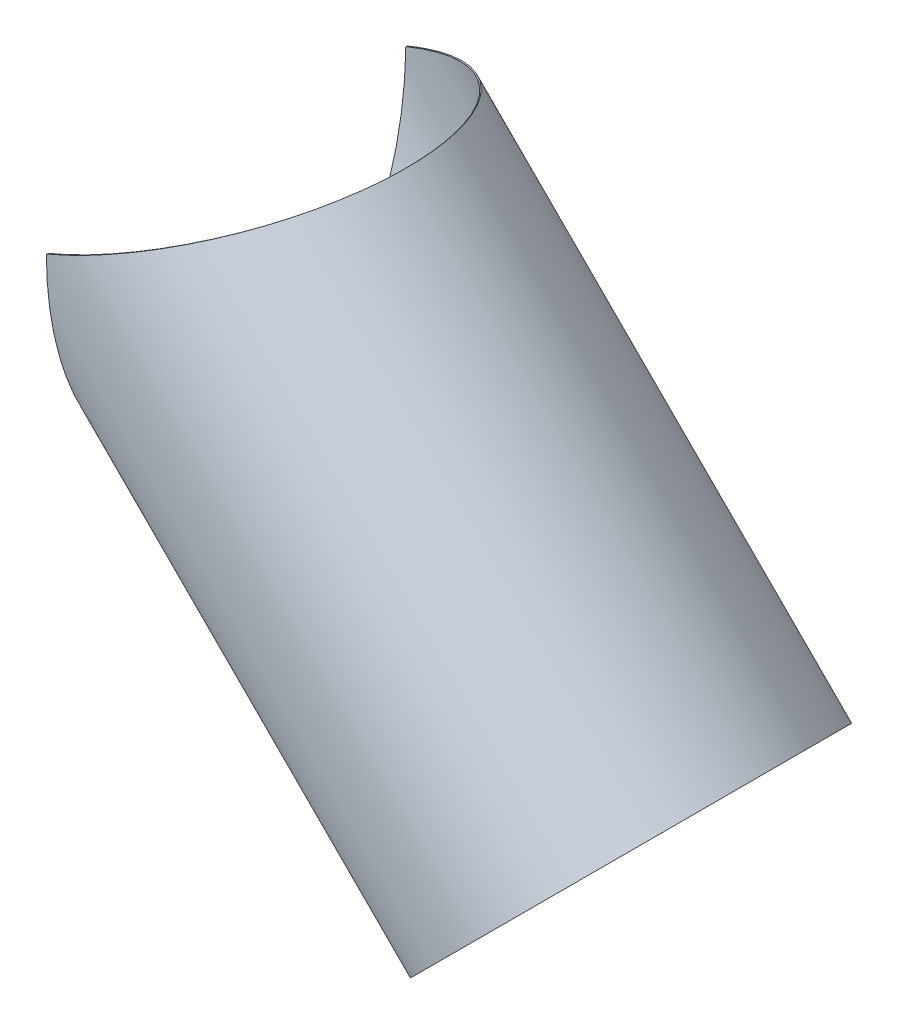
ISO-10303-21;
HEADER;
FILE_DESCRIPTION(('STEP AP214'),'2;1');
FILE_NAME('part.step','',(''),(''),'','','');
FILE_SCHEMA(('AUTOMOTIVE_DESIGN { 1 0 10303 214 1 1 1 1 }'));
ENDSEC;
DATA;
#1=APPLICATION_CONTEXT('core data for automotive mechanical design processes');
#2=APPLICATION_PROTOCOL_DEFINITION('international standard','automotive_design',2000,#1);
#3=PRODUCT_CONTEXT('',#1,'mechanical');
#4=PRODUCT('Part','Part','',(#3));
#5=PRODUCT_RELATED_PRODUCT_CATEGORY('part','',(#4));
#6=PRODUCT_DEFINITION_FORMATION('','',#4);
#7=PRODUCT_DEFINITION_CONTEXT('part definition',#1,'design');
#8=PRODUCT_DEFINITION('design','',#6,#7);
#9=PRODUCT_DEFINITION_SHAPE('','',#8);
#10=(LENGTH_UNIT() NAMED_UNIT(*) SI_UNIT(.MILLI.,.METRE.));
#11=(NAMED_UNIT(*) PLANE_ANGLE_UNIT() SI_UNIT($,.RADIAN.));
#12=(NAMED_UNIT(*) SI_UNIT($,.STERADIAN.) SOLID_ANGLE_UNIT());
#13=UNCERTAINTY_MEASURE_WITH_UNIT(LENGTH_MEASURE(1.E-05),#10,'distance_accuracy_value','');
#14=(GEOMETRIC_REPRESENTATION_CONTEXT(3) GLOBAL_UNCERTAINTY_ASSIGNED_CONTEXT((#13)) GLOBAL_UNIT_ASSIGNED_CONTEXT((#10,
#11,#12)) REPRESENTATION_CONTEXT('',''));
#15=CARTESIAN_POINT('',(0.,0.,0.));
#16=DIRECTION('',(0.,0.,1.));
#17=DIRECTION('',(1.,0.,0.));
#18=AXIS2_PLACEMENT_3D('',#15,#16,#17);
#19=CARTESIAN_POINT('',(0.337482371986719,-1000.81475451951,0.));
#20=DIRECTION('',(0.707106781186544,-0.707106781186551,0.));
#21=DIRECTION('',(0.707106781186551,0.707106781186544,0.));
#22=AXIS2_PLACEMENT_3D('',#19,#20,#21);
#23=CYLINDRICAL_SURFACE('',#22,315.);
#24=CARTESIAN_POINT('',(1.22514845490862E-13,-1000.47727214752,0.));
#25=DIRECTION('',(1.,0.,0.));
#26=DIRECTION('',(0.,-1.,0.));
#27=AXIS2_PLACEMENT_3D('',#24,#25,#26);
#28=ELLIPSE('',#27,445.477272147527,315.);
#29=CARTESIAN_POINT('',(-1.94289029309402E-13,-1445.95229950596,-1.00000000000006));
#30=VERTEX_POINT('',#29);
#31=CARTESIAN_POINT('',(1.15196480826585E-13,-1001.1522368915,-314.999638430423));
#32=VERTEX_POINT('',#31);
#33=EDGE_CURVE('E49',#30,#32,#28,.T.);
#34=ORIENTED_EDGE('',*,*,#33,.T.);
#35=CARTESIAN_POINT('',(0.337482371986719,-1000.81475451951,0.));
#36=DIRECTION('',(-0.707106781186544,0.707106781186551,0.));
#37=DIRECTION('',(-0.707106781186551,-0.707106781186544,0.));
#38=AXIS2_PLACEMENT_3D('',#35,#36,#37);
#39=CIRCLE('',#38,315.);
#40=CARTESIAN_POINT('',(1.15223689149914,-999.999999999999,-314.99789261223));
#41=VERTEX_POINT('',#40);
#42=EDGE_CURVE('E111',#41,#32,#39,.T.);
#43=ORIENTED_EDGE('',*,*,#42,.F.);
#44=CARTESIAN_POINT('',(0.,-1000.47727214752,0.));
#45=DIRECTION('',(0.382683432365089,-0.923879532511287,0.));
#46=DIRECTION('',(0.923879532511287,0.382683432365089,0.));
#47=AXIS2_PLACEMENT_3D('',#44,#45,#46);
#48=ELLIPSE('',#47,340.953543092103,315.);
#49=CARTESIAN_POINT('',(1.15223689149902,-999.999999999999,314.99789261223));
#50=VERTEX_POINT('',#49);
#51=EDGE_CURVE('E57',#41,#50,#48,.T.);
#52=ORIENTED_EDGE('',*,*,#51,.T.);
#53=CARTESIAN_POINT('',(2.30440124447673E-11,-1001.15223689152,314.999638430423));
#54=VERTEX_POINT('',#53);
#55=EDGE_CURVE('E118',#54,#50,#39,.T.);
#56=ORIENTED_EDGE('',*,*,#55,.F.);
#57=CARTESIAN_POINT('',(1.22514845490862E-13,-1000.47727214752,0.));
#58=DIRECTION('',(1.,0.,0.));
#59=DIRECTION('',(0.,-1.,0.));
#60=AXIS2_PLACEMENT_3D('',#57,#58,#59);
#61=ELLIPSE('',#60,445.477272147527,315.);
#62=CARTESIAN_POINT('',(2.05781572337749E-13,-1445.95229950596,1.));
#63=VERTEX_POINT('',#62);
#64=EDGE_CURVE('E159',#54,#63,#61,.T.);
#65=ORIENTED_EDGE('',*,*,#64,.T.);
#66=DIRECTION('',(0.707106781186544,-0.707106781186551,0.));
#67=VECTOR('',#66,1.);
#68=CARTESIAN_POINT('',(-222.400031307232,-1223.55226819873,1.));
#69=LINE('',#68,#67);
#70=CARTESIAN_POINT('',(484.706749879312,-1930.65904938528,1.));
#71=VERTEX_POINT('',#70);
#72=EDGE_CURVE('E120',#63,#71,#69,.T.);
#73=ORIENTED_EDGE('',*,*,#72,.T.);
#74=CARTESIAN_POINT('',(707.444263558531,-1707.92153570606,0.));
#75=DIRECTION('',(-0.707106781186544,0.707106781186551,0.));
#76=DIRECTION('',(-0.707106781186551,-0.707106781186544,0.));
#77=AXIS2_PLACEMENT_3D('',#74,#75,#76);
#78=CIRCLE('',#77,315.);
#79=CARTESIAN_POINT('',(484.706749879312,-1930.65904938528,-1.00000000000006));
#80=VERTEX_POINT('',#79);
#81=EDGE_CURVE('E125',#71,#80,#78,.T.);
#82=ORIENTED_EDGE('',*,*,#81,.T.);
#83=DIRECTION('',(0.707106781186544,-0.707106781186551,0.));
#84=VECTOR('',#83,1.);
#85=CARTESIAN_POINT('',(-222.400031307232,-1223.55226819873,-1.00000000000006));
#86=LINE('',#85,#84);
#87=EDGE_CURVE('E11',#30,#80,#86,.T.);
#88=ORIENTED_EDGE('',*,*,#87,.F.);
#89=EDGE_LOOP('',(#34,#43,#52,#56,#65,#73,#82,#88));
#90=FACE_BOUND('',#89,.T.);
#91=ADVANCED_FACE('F35',(#90),#23,.T.);
#92=CARTESIAN_POINT('',(0.337482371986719,-1000.81475451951,0.));
#93=DIRECTION('',(0.707106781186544,-0.707106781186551,0.));
#94=DIRECTION('',(0.707106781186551,0.707106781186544,0.));
#95=AXIS2_PLACEMENT_3D('',#92,#93,#94);
#96=CYLINDRICAL_SURFACE('',#95,313.);
#97=CARTESIAN_POINT('',(0.337482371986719,-1000.81475451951,0.));
#98=DIRECTION('',(-0.707106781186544,0.707106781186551,0.));
#99=DIRECTION('',(-0.707106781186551,-0.707106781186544,0.));
#100=AXIS2_PLACEMENT_3D('',#97,#98,#99);
#101=CIRCLE('',#100,313.);
#102=CARTESIAN_POINT('',(1.14706384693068,-1000.00517304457,-312.997905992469));
#103=VERTEX_POINT('',#102);
#104=CARTESIAN_POINT('',(0.00214274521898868,-1001.15009414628,-312.999640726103));
#105=VERTEX_POINT('',#104);
#106=EDGE_CURVE('E109',#103,#105,#101,.T.);
#107=ORIENTED_EDGE('',*,*,#106,.T.);
#108=CARTESIAN_POINT('',(1.22514845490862E-13,-1000.47727214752,0.));
#109=DIRECTION('',(0.999994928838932,0.0031846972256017,0.));
#110=DIRECTION('',(0.0031846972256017,-0.999994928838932,0.));
#111=AXIS2_PLACEMENT_3D('',#108,#109,#110);
#112=ELLIPSE('',#111,444.065310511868,313.);
#113=CARTESIAN_POINT('',(1.41420643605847,-1444.5380930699,-0.993650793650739));
#114=VERTEX_POINT('',#113);
#115=EDGE_CURVE('E96',#114,#105,#112,.T.);
#116=ORIENTED_EDGE('',*,*,#115,.F.);
#117=DIRECTION('',(0.707106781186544,-0.707106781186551,0.));
#118=VECTOR('',#117,1.);
#119=CARTESIAN_POINT('',(-220.985824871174,-1222.13806176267,-0.993650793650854));
#120=LINE('',#119,#118);
#121=CARTESIAN_POINT('',(486.12095631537,-1929.24484294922,-0.993650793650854));
#122=VERTEX_POINT('',#121);
#123=EDGE_CURVE('E42',#114,#122,#120,.T.);
#124=ORIENTED_EDGE('',*,*,#123,.T.);
#125=CARTESIAN_POINT('',(707.444263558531,-1707.92153570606,0.));
#126=DIRECTION('',(-0.707106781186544,0.707106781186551,0.));
#127=DIRECTION('',(-0.707106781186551,-0.707106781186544,0.));
#128=AXIS2_PLACEMENT_3D('',#125,#126,#127);
#129=CIRCLE('',#128,313.);
#130=CARTESIAN_POINT('',(486.12095631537,-1929.24484294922,0.993650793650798));
#131=VERTEX_POINT('',#130);
#132=EDGE_CURVE('E132',#131,#122,#129,.T.);
#133=ORIENTED_EDGE('',*,*,#132,.F.);
#134=DIRECTION('',(0.707106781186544,-0.707106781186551,0.));
#135=VECTOR('',#134,1.);
#136=CARTESIAN_POINT('',(-220.985824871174,-1222.13806176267,0.993650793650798));
#137=LINE('',#136,#135);
#138=CARTESIAN_POINT('',(1.41420643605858,-1444.5380930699,0.993650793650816));
#139=VERTEX_POINT('',#138);
#140=EDGE_CURVE('E139',#139,#131,#137,.T.);
#141=ORIENTED_EDGE('',*,*,#140,.F.);
#142=CARTESIAN_POINT('',(1.22514845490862E-13,-1000.47727214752,0.));
#143=DIRECTION('',(0.999994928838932,0.0031846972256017,0.));
#144=DIRECTION('',(0.0031846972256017,-0.999994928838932,0.));
#145=AXIS2_PLACEMENT_3D('',#142,#143,#144);
#146=ELLIPSE('',#145,444.065310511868,313.);
#147=CARTESIAN_POINT('',(0.00214274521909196,-1001.15009414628,312.999640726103));
#148=VERTEX_POINT('',#147);
#149=EDGE_CURVE('E155',#148,#139,#146,.T.);
#150=ORIENTED_EDGE('',*,*,#149,.F.);
#151=CARTESIAN_POINT('',(1.14706384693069,-1000.00517304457,312.997905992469));
#152=VERTEX_POINT('',#151);
#153=EDGE_CURVE('E117',#148,#152,#101,.T.);
#154=ORIENTED_EDGE('',*,*,#153,.T.);
#155=CARTESIAN_POINT('',(0.,-1000.47727214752,0.));
#156=DIRECTION('',(0.380597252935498,-0.924740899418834,0.));
#157=DIRECTION('',(0.924740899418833,0.380597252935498,0.));
#158=AXIS2_PLACEMENT_3D('',#155,#156,#157);
#159=ELLIPSE('',#158,339.106647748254,313.);
#160=EDGE_CURVE('E116',#103,#152,#159,.T.);
#161=ORIENTED_EDGE('',*,*,#160,.F.);
#162=EDGE_LOOP('',(#107,#116,#124,#133,#141,#150,#154,#161));
#163=FACE_BOUND('',#162,.T.);
#164=ADVANCED_FACE('F114',(#163),#96,.F.);
#165=CARTESIAN_POINT('',(0.337482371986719,-1000.81475451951,0.));
#166=DIRECTION('',(-0.707106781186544,0.707106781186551,0.));
#167=DIRECTION('',(-0.707106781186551,-0.707106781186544,0.));
#168=AXIS2_PLACEMENT_3D('',#165,#166,#167);
#169=PLANE('',#168);
#170=ORIENTED_EDGE('',*,*,#42,.T.);
#171=DIRECTION('',(-0.0010713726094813,-0.00107137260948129,-0.999998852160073));
#172=VECTOR('',#171,1.);
#173=CARTESIAN_POINT('',(1.15196480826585E-13,-1001.1522368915,-314.999638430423));
#174=LINE('',#173,#172);
#175=EDGE_CURVE('E99',#32,#105,#174,.F.);
#176=ORIENTED_EDGE('',*,*,#175,.T.);
#177=ORIENTED_EDGE('',*,*,#106,.F.);
#178=DIRECTION('',(0.00258652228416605,0.00258652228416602,-0.999993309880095));
#179=VECTOR('',#178,1.);
#180=CARTESIAN_POINT('',(1.15223689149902,-999.999999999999,-314.99789261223));
#181=LINE('',#180,#179);
#182=EDGE_CURVE('E167',#41,#103,#181,.F.);
#183=ORIENTED_EDGE('',*,*,#182,.F.);
#184=EDGE_LOOP('',(#170,#176,#177,#183));
#185=FACE_BOUND('',#184,.T.);
#186=ADVANCED_FACE('F108',(#185),#169,.T.);
#187=CARTESIAN_POINT('',(-220.985824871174,-1222.13806176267,-0.993650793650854));
#188=DIRECTION('',(-0.00224478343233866,-0.00224478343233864,0.999994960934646));
#189=DIRECTION('',(0.999997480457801,0.,0.002244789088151));
#190=AXIS2_PLACEMENT_3D('',#187,#188,#189);
#191=PLANE('',#190);
#192=ORIENTED_EDGE('',*,*,#123,.F.);
#193=DIRECTION('',(-0.707103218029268,-0.707103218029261,-0.00317460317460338));
#194=VECTOR('',#193,1.);
#195=CARTESIAN_POINT('',(1.38604691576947E-13,-1445.95229950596,-1.00000000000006));
#196=LINE('',#195,#194);
#197=EDGE_CURVE('E100',#30,#114,#196,.F.);
#198=ORIENTED_EDGE('',*,*,#197,.F.);
#199=ORIENTED_EDGE('',*,*,#87,.T.);
#200=DIRECTION('',(-0.707103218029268,-0.707103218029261,-0.00317460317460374));
#201=VECTOR('',#200,1.);
#202=CARTESIAN_POINT('',(486.12095631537,-1929.24484294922,-0.993650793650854));
#203=LINE('',#202,#201);
#204=EDGE_CURVE('E128',#122,#80,#203,.T.);
#205=ORIENTED_EDGE('',*,*,#204,.F.);
#206=EDGE_LOOP('',(#192,#198,#199,#205));
#207=FACE_BOUND('',#206,.T.);
#208=ADVANCED_FACE('F144',(#207),#191,.T.);
#209=ORIENTED_EDGE('',*,*,#55,.T.);
#210=DIRECTION('',(0.00258652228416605,0.00258652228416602,0.999993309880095));
#211=VECTOR('',#210,1.);
#212=CARTESIAN_POINT('',(1.15223689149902,-999.999999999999,314.99789261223));
#213=LINE('',#212,#211);
#214=EDGE_CURVE('E166',#50,#152,#213,.F.);
#215=ORIENTED_EDGE('',*,*,#214,.T.);
#216=ORIENTED_EDGE('',*,*,#153,.F.);
#217=DIRECTION('',(-0.0010713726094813,-0.00107137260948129,0.999998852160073));
#218=VECTOR('',#217,1.);
#219=CARTESIAN_POINT('',(1.15196480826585E-13,-1001.1522368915,314.999638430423));
#220=LINE('',#219,#218);
#221=EDGE_CURVE('E158',#54,#148,#220,.F.);
#222=ORIENTED_EDGE('',*,*,#221,.F.);
#223=EDGE_LOOP('',(#209,#215,#216,#222));
#224=FACE_BOUND('',#223,.T.);
#225=ADVANCED_FACE('F164',(#224),#169,.T.);
#226=CARTESIAN_POINT('',(-222.400031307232,-1223.55226819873,1.));
#227=DIRECTION('',(-0.00224478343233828,-0.00224478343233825,-0.999994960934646));
#228=DIRECTION('',(-0.999997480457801,0.,0.00224478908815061));
#229=AXIS2_PLACEMENT_3D('',#226,#227,#228);
#230=PLANE('',#229);
#231=ORIENTED_EDGE('',*,*,#72,.F.);
#232=DIRECTION('',(-0.707103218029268,-0.707103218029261,0.00317460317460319));
#233=VECTOR('',#232,1.);
#234=CARTESIAN_POINT('',(2.05781572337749E-13,-1445.95229950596,1.));
#235=LINE('',#234,#233);
#236=EDGE_CURVE('E129',#63,#139,#235,.F.);
#237=ORIENTED_EDGE('',*,*,#236,.T.);
#238=ORIENTED_EDGE('',*,*,#140,.T.);
#239=DIRECTION('',(0.707103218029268,0.707103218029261,-0.0031746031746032));
#240=VECTOR('',#239,1.);
#241=CARTESIAN_POINT('',(484.706749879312,-1930.65904938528,1.));
#242=LINE('',#241,#240);
#243=EDGE_CURVE('E135',#71,#131,#242,.T.);
#244=ORIENTED_EDGE('',*,*,#243,.F.);
#245=EDGE_LOOP('',(#231,#237,#238,#244));
#246=FACE_BOUND('',#245,.T.);
#247=ADVANCED_FACE('F152',(#246),#230,.T.);
#248=CARTESIAN_POINT('',(707.444263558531,-1707.92153570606,0.));
#249=DIRECTION('',(-0.707106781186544,0.707106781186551,0.));
#250=DIRECTION('',(-0.707106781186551,-0.707106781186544,0.));
#251=AXIS2_PLACEMENT_3D('',#248,#249,#250);
#252=PLANE('',#251);
#253=ORIENTED_EDGE('',*,*,#81,.F.);
#254=ORIENTED_EDGE('',*,*,#243,.T.);
#255=ORIENTED_EDGE('',*,*,#132,.T.);
#256=ORIENTED_EDGE('',*,*,#204,.T.);
#257=EDGE_LOOP('',(#253,#254,#255,#256));
#258=FACE_BOUND('',#257,.T.);
#259=ADVANCED_FACE('F148',(#258),#252,.F.);
#260=CARTESIAN_POINT('',(1.41421356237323,-1444.54033073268,0.));
#261=CARTESIAN_POINT('',(0.942809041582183,-1445.01173525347,0.));
#262=CARTESIAN_POINT('',(0.471404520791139,-1445.48313977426,0.));
#263=CARTESIAN_POINT('',(0.,-1445.95454429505,0.));
#264=CARTESIAN_POINT('',(1.41421356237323,-1444.54033073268,-625.999999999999));
#265=CARTESIAN_POINT('',(0.942809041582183,-1445.01173525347,-627.333333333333));
#266=CARTESIAN_POINT('',(0.471404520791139,-1445.48313977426,-628.666666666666));
#267=CARTESIAN_POINT('',(0.,-1445.95454429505,-629.999999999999));
#268=CARTESIAN_POINT('',(-1.41421356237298,-556.414213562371,-625.999999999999));
#269=CARTESIAN_POINT('',(-0.942809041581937,-555.94280904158,-627.333333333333));
#270=CARTESIAN_POINT('',(-0.471404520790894,-555.47140452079,-628.666666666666));
#271=CARTESIAN_POINT('',(1.50270421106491E-13,-554.999999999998,-629.999999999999));
#272=CARTESIAN_POINT('',(-1.41421356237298,-556.414213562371,0.));
#273=CARTESIAN_POINT('',(-0.942809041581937,-555.94280904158,0.));
#274=CARTESIAN_POINT('',(-0.471404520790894,-555.471404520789,0.));
#275=CARTESIAN_POINT('',(1.50270421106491E-13,-554.999999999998,0.));
#276=CARTESIAN_POINT('',(-1.41421356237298,-556.414213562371,625.999999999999));
#277=CARTESIAN_POINT('',(-0.942809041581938,-555.94280904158,627.333333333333));
#278=CARTESIAN_POINT('',(-0.471404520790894,-555.471404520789,628.666666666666));
#279=CARTESIAN_POINT('',(1.50270421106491E-13,-554.999999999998,629.999999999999));
#280=CARTESIAN_POINT('',(1.41421356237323,-1444.54033073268,625.999999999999));
#281=CARTESIAN_POINT('',(0.942809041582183,-1445.01173525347,627.333333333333));
#282=CARTESIAN_POINT('',(0.471404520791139,-1445.48313977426,628.666666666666));
#283=CARTESIAN_POINT('',(0.,-1445.95454429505,629.999999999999));
#284=CARTESIAN_POINT('',(1.41421356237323,-1444.54033073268,0.));
#285=CARTESIAN_POINT('',(0.942809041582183,-1445.01173525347,0.));
#286=CARTESIAN_POINT('',(0.471404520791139,-1445.48313977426,0.));
#287=CARTESIAN_POINT('',(0.,-1445.95454429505,0.));
#288=(BOUNDED_SURFACE() B_SPLINE_SURFACE(3,3,((#260,#261,#262,#263),(#264,#265,#266,#267),(#268,
#269,#270,#271),(#272,#273,#274,#275),(#276,#277,#278,#279),(#280,#281,#282,#283),(#284,#285,
#286,#287)),.UNSPECIFIED.,.T.,.F.,.F.) B_SPLINE_SURFACE_WITH_KNOTS((4,3,4),(4,4),(0.,0.5,1.),
(0.,1.),.UNSPECIFIED.) GEOMETRIC_REPRESENTATION_ITEM() RATIONAL_B_SPLINE_SURFACE(((1.,1.,1.,1.),
(0.333333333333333,0.333333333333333,0.333333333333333,0.333333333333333),(0.333333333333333,
0.333333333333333,0.333333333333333,0.333333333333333),(1.,1.,1.,1.),(0.333333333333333,
0.333333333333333,0.333333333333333,0.333333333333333),(0.333333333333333,0.333333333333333,
0.333333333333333,0.333333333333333),(1.,1.,1.,1.))) REPRESENTATION_ITEM('') SURFACE());
#289=ORIENTED_EDGE('',*,*,#236,.F.);
#290=ORIENTED_EDGE('',*,*,#64,.F.);
#291=ORIENTED_EDGE('',*,*,#221,.T.);
#292=ORIENTED_EDGE('',*,*,#149,.T.);
#293=EDGE_LOOP('',(#289,#290,#291,#292));
#294=FACE_BOUND('',#293,.T.);
#295=ADVANCED_FACE('F175',(#294),#288,.T.);
#296=CARTESIAN_POINT('',(313.585786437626,-871.414213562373,0.));
#297=CARTESIAN_POINT('',(314.057190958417,-870.942809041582,0.));
#298=CARTESIAN_POINT('',(314.528595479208,-870.471404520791,0.));
#299=CARTESIAN_POINT('',(314.999999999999,-870.,0.));
#300=CARTESIAN_POINT('',(313.585786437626,-871.414213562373,625.999999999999));
#301=CARTESIAN_POINT('',(314.057190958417,-870.942809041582,627.333333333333));
#302=CARTESIAN_POINT('',(314.528595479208,-870.471404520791,628.666666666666));
#303=CARTESIAN_POINT('',(314.999999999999,-870.,629.999999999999));
#304=CARTESIAN_POINT('',(-313.585786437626,-1129.54033073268,625.999999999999));
#305=CARTESIAN_POINT('',(-314.057190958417,-1130.01173525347,627.333333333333));
#306=CARTESIAN_POINT('',(-314.528595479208,-1130.48313977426,628.666666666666));
#307=CARTESIAN_POINT('',(-314.999999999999,-1130.95454429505,629.999999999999));
#308=CARTESIAN_POINT('',(-313.585786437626,-1129.54033073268,0.));
#309=CARTESIAN_POINT('',(-314.057190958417,-1130.01173525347,0.));
#310=CARTESIAN_POINT('',(-314.528595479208,-1130.48313977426,0.));
#311=CARTESIAN_POINT('',(-314.999999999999,-1130.95454429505,0.));
#312=CARTESIAN_POINT('',(-313.585786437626,-1129.54033073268,-625.999999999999));
#313=CARTESIAN_POINT('',(-314.057190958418,-1130.01173525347,-627.333333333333));
#314=CARTESIAN_POINT('',(-314.528595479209,-1130.48313977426,-628.666666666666));
#315=CARTESIAN_POINT('',(-315.,-1130.95454429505,-629.999999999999));
#316=CARTESIAN_POINT('',(313.585786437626,-871.414213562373,-625.999999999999));
#317=CARTESIAN_POINT('',(314.057190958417,-870.942809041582,-627.333333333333));
#318=CARTESIAN_POINT('',(314.528595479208,-870.471404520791,-628.666666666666));
#319=CARTESIAN_POINT('',(314.999999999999,-870.,-629.999999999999));
#320=CARTESIAN_POINT('',(313.585786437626,-871.414213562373,0.));
#321=CARTESIAN_POINT('',(314.057190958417,-870.942809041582,0.));
#322=CARTESIAN_POINT('',(314.528595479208,-870.471404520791,0.));
#323=CARTESIAN_POINT('',(314.999999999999,-870.,0.));
#324=(BOUNDED_SURFACE() B_SPLINE_SURFACE(3,3,((#296,#297,#298,#299),(#300,#301,#302,#303),(#304,
#305,#306,#307),(#308,#309,#310,#311),(#312,#313,#314,#315),(#316,#317,#318,#319),(#320,#321,
#322,#323)),.UNSPECIFIED.,.T.,.F.,.F.) B_SPLINE_SURFACE_WITH_KNOTS((4,3,4),(4,4),(0.,0.5,1.),
(0.,1.),.UNSPECIFIED.) GEOMETRIC_REPRESENTATION_ITEM() RATIONAL_B_SPLINE_SURFACE(((1.,1.,1.,1.),
(0.333333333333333,0.333333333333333,0.333333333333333,0.333333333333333),(0.333333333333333,
0.333333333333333,0.333333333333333,0.333333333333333),(1.,1.,1.,1.),(0.333333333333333,
0.333333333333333,0.333333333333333,0.333333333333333),(0.333333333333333,0.333333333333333,
0.333333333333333,0.333333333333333),(1.,1.,1.,1.))) REPRESENTATION_ITEM('') SURFACE());
#325=ORIENTED_EDGE('',*,*,#214,.F.);
#326=ORIENTED_EDGE('',*,*,#51,.F.);
#327=ORIENTED_EDGE('',*,*,#182,.T.);
#328=ORIENTED_EDGE('',*,*,#160,.T.);
#329=EDGE_LOOP('',(#325,#326,#327,#328));
#330=FACE_BOUND('',#329,.T.);
#331=ADVANCED_FACE('F179',(#330),#324,.T.);
#332=CARTESIAN_POINT('',(1.41421356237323,-1444.54033073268,0.));
#333=CARTESIAN_POINT('',(0.942809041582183,-1445.01173525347,0.));
#334=CARTESIAN_POINT('',(0.471404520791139,-1445.48313977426,0.));
#335=CARTESIAN_POINT('',(0.,-1445.95454429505,0.));
#336=CARTESIAN_POINT('',(1.41421356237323,-1444.54033073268,-625.999999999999));
#337=CARTESIAN_POINT('',(0.942809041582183,-1445.01173525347,-627.333333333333));
#338=CARTESIAN_POINT('',(0.471404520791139,-1445.48313977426,-628.666666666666));
#339=CARTESIAN_POINT('',(0.,-1445.95454429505,-629.999999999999));
#340=CARTESIAN_POINT('',(-1.41421356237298,-556.414213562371,-625.999999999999));
#341=CARTESIAN_POINT('',(-0.942809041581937,-555.94280904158,-627.333333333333));
#342=CARTESIAN_POINT('',(-0.471404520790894,-555.47140452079,-628.666666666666));
#343=CARTESIAN_POINT('',(1.50270421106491E-13,-554.999999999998,-629.999999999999));
#344=CARTESIAN_POINT('',(-1.41421356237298,-556.414213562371,0.));
#345=CARTESIAN_POINT('',(-0.942809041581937,-555.94280904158,0.));
#346=CARTESIAN_POINT('',(-0.471404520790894,-555.471404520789,0.));
#347=CARTESIAN_POINT('',(1.50270421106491E-13,-554.999999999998,0.));
#348=CARTESIAN_POINT('',(-1.41421356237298,-556.414213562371,625.999999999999));
#349=CARTESIAN_POINT('',(-0.942809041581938,-555.94280904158,627.333333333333));
#350=CARTESIAN_POINT('',(-0.471404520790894,-555.471404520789,628.666666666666));
#351=CARTESIAN_POINT('',(1.50270421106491E-13,-554.999999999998,629.999999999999));
#352=CARTESIAN_POINT('',(1.41421356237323,-1444.54033073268,625.999999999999));
#353=CARTESIAN_POINT('',(0.942809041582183,-1445.01173525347,627.333333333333));
#354=CARTESIAN_POINT('',(0.471404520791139,-1445.48313977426,628.666666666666));
#355=CARTESIAN_POINT('',(0.,-1445.95454429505,629.999999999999));
#356=CARTESIAN_POINT('',(1.41421356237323,-1444.54033073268,0.));
#357=CARTESIAN_POINT('',(0.942809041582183,-1445.01173525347,0.));
#358=CARTESIAN_POINT('',(0.471404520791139,-1445.48313977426,0.));
#359=CARTESIAN_POINT('',(0.,-1445.95454429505,0.));
#360=(BOUNDED_SURFACE() B_SPLINE_SURFACE(3,3,((#332,#333,#334,#335),(#336,#337,#338,#339),(#340,
#341,#342,#343),(#344,#345,#346,#347),(#348,#349,#350,#351),(#352,#353,#354,#355),(#356,#357,
#358,#359)),.UNSPECIFIED.,.T.,.F.,.F.) B_SPLINE_SURFACE_WITH_KNOTS((4,3,4),(4,4),(0.,0.5,1.),
(0.,1.),.UNSPECIFIED.) GEOMETRIC_REPRESENTATION_ITEM() RATIONAL_B_SPLINE_SURFACE(((1.,1.,1.,1.),
(0.333333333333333,0.333333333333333,0.333333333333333,0.333333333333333),(0.333333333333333,
0.333333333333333,0.333333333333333,0.333333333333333),(1.,1.,1.,1.),(0.333333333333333,
0.333333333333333,0.333333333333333,0.333333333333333),(0.333333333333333,0.333333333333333,
0.333333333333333,0.333333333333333),(1.,1.,1.,1.))) REPRESENTATION_ITEM('') SURFACE());
#361=ORIENTED_EDGE('',*,*,#175,.F.);
#362=ORIENTED_EDGE('',*,*,#33,.F.);
#363=ORIENTED_EDGE('',*,*,#197,.T.);
#364=ORIENTED_EDGE('',*,*,#115,.T.);
#365=EDGE_LOOP('',(#361,#362,#363,#364));
#366=FACE_BOUND('',#365,.T.);
#367=ADVANCED_FACE('F98',(#366),#360,.T.);
#368=CLOSED_SHELL('',(#91,#164,#186,#208,#225,#247,#259,#295,#331,#367));
#369=MANIFOLD_SOLID_BREP('B2',#368);
#370=ADVANCED_BREP_SHAPE_REPRESENTATION('',(#18,#369),#14);
#371=SHAPE_DEFINITION_REPRESENTATION(#9,#370);
ENDSEC;
END-ISO-10303-21;
